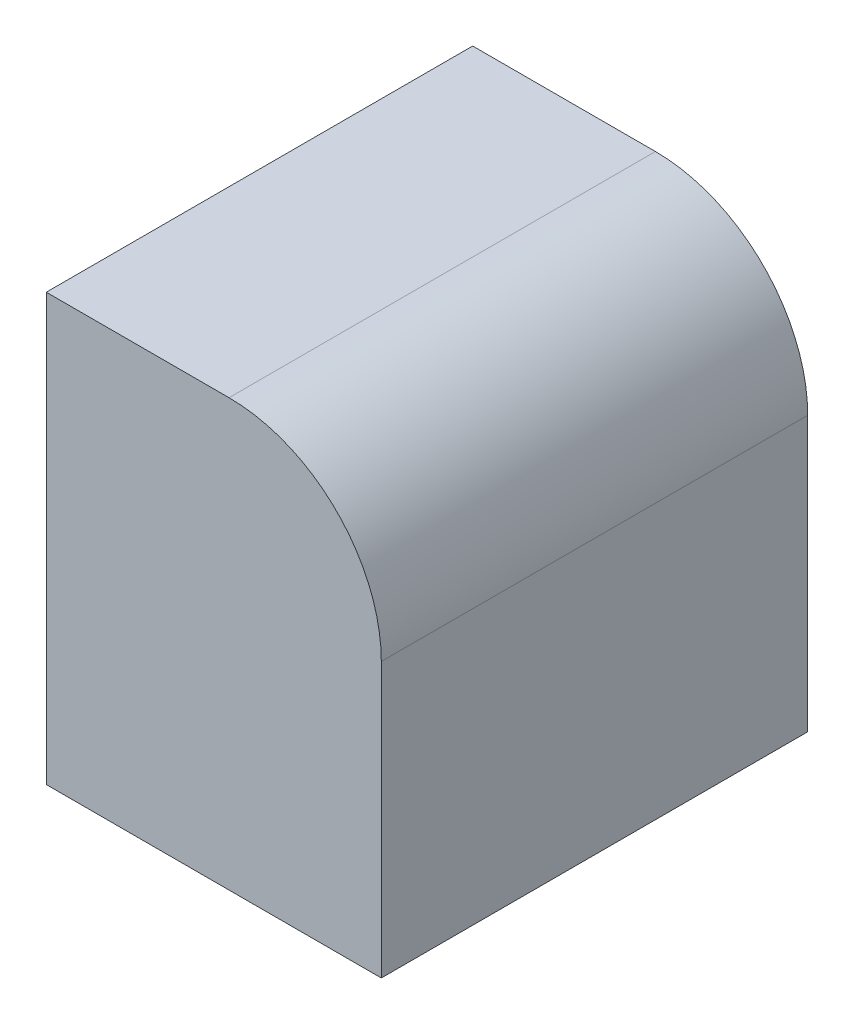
from build123d import *

# Parameters (mm, degrees)
SKETCH1_W           = 70
SKETCH1_H           = 70
BOSS_EXTRUDE1_DEPTH = 55
CIRCULAR_R          = 25


with BuildPart() as part:
    # Sketch1 → Boss-Extrude1 (new body)
    with BuildSketch(Plane(origin=(0, 0, 0), x_dir=(0, 0, -1), z_dir=(1, 0, 0))):
        with Locations((35, 35)):
            Rectangle(SKETCH1_W, SKETCH1_H)
    extrude(amount=BOSS_EXTRUDE1_DEPTH)

    # Circular
    circular_edges = [part.edges().sort_by_distance(p)[0] for p in [
        (55, 70, -35),
    ]]
    fillet(circular_edges, radius=CIRCULAR_R)


solid = part.part
